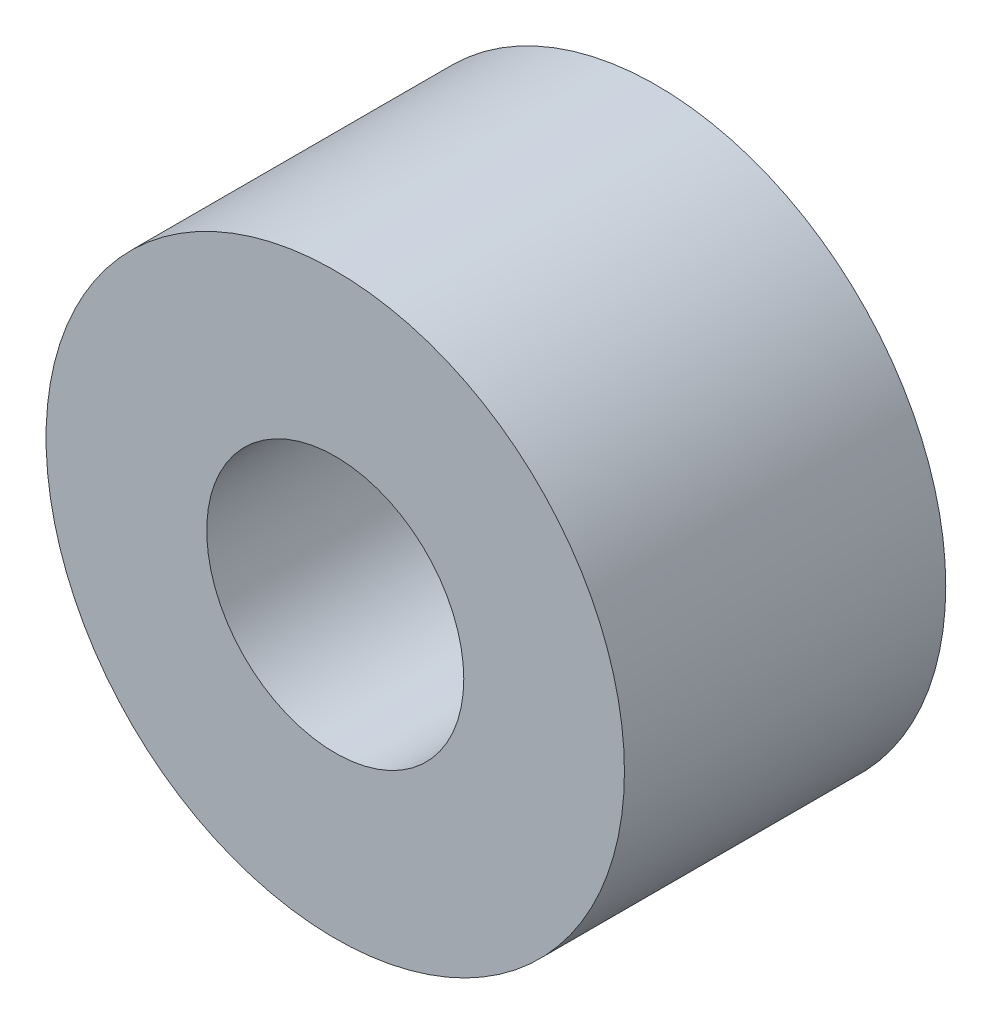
ISO-10303-21;
HEADER;
FILE_DESCRIPTION(('STEP AP214'),'2;1');
FILE_NAME('part.step','',(''),(''),'','','');
FILE_SCHEMA(('AUTOMOTIVE_DESIGN { 1 0 10303 214 1 1 1 1 }'));
ENDSEC;
DATA;
#1=APPLICATION_CONTEXT('core data for automotive mechanical design processes');
#2=APPLICATION_PROTOCOL_DEFINITION('international standard','automotive_design',2000,#1);
#3=PRODUCT_CONTEXT('',#1,'mechanical');
#4=PRODUCT('Part','Part','',(#3));
#5=PRODUCT_RELATED_PRODUCT_CATEGORY('part','',(#4));
#6=PRODUCT_DEFINITION_FORMATION('','',#4);
#7=PRODUCT_DEFINITION_CONTEXT('part definition',#1,'design');
#8=PRODUCT_DEFINITION('design','',#6,#7);
#9=PRODUCT_DEFINITION_SHAPE('','',#8);
#10=(LENGTH_UNIT() NAMED_UNIT(*) SI_UNIT(.MILLI.,.METRE.));
#11=(NAMED_UNIT(*) PLANE_ANGLE_UNIT() SI_UNIT($,.RADIAN.));
#12=(NAMED_UNIT(*) SI_UNIT($,.STERADIAN.) SOLID_ANGLE_UNIT());
#13=UNCERTAINTY_MEASURE_WITH_UNIT(LENGTH_MEASURE(1.E-05),#10,'distance_accuracy_value','');
#14=(GEOMETRIC_REPRESENTATION_CONTEXT(3) GLOBAL_UNCERTAINTY_ASSIGNED_CONTEXT((#13)) GLOBAL_UNIT_ASSIGNED_CONTEXT((#10,
#11,#12)) REPRESENTATION_CONTEXT('',''));
#15=CARTESIAN_POINT('',(0.,0.,0.));
#16=DIRECTION('',(0.,0.,1.));
#17=DIRECTION('',(1.,0.,0.));
#18=AXIS2_PLACEMENT_3D('',#15,#16,#17);
#19=CARTESIAN_POINT('',(0.,0.,5.));
#20=DIRECTION('',(0.,0.,1.));
#21=DIRECTION('',(1.,0.,0.));
#22=AXIS2_PLACEMENT_3D('',#19,#20,#21);
#23=PLANE('',#22);
#24=CARTESIAN_POINT('',(0.,0.,5.));
#25=DIRECTION('',(0.,0.,1.));
#26=DIRECTION('',(1.,0.,0.));
#27=AXIS2_PLACEMENT_3D('',#24,#25,#26);
#28=CIRCLE('',#27,4.5);
#29=CARTESIAN_POINT('',(4.5,0.,5.));
#30=VERTEX_POINT('',#29);
#31=EDGE_CURVE('E10',#30,#30,#28,.T.);
#32=ORIENTED_EDGE('',*,*,#31,.T.);
#33=EDGE_LOOP('',(#32));
#34=FACE_BOUND('',#33,.T.);
#35=CARTESIAN_POINT('',(0.,0.,5.));
#36=DIRECTION('',(0.,0.,1.));
#37=DIRECTION('',(1.,0.,0.));
#38=AXIS2_PLACEMENT_3D('',#35,#36,#37);
#39=CIRCLE('',#38,2.);
#40=CARTESIAN_POINT('',(2.,0.,5.));
#41=VERTEX_POINT('',#40);
#42=EDGE_CURVE('E35',#41,#41,#39,.T.);
#43=ORIENTED_EDGE('',*,*,#42,.F.);
#44=EDGE_LOOP('',(#43));
#45=FACE_BOUND('',#44,.T.);
#46=ADVANCED_FACE('F24',(#34,#45),#23,.T.);
#47=CARTESIAN_POINT('',(0.,0.,0.));
#48=DIRECTION('',(0.,0.,1.));
#49=DIRECTION('',(1.,0.,0.));
#50=AXIS2_PLACEMENT_3D('',#47,#48,#49);
#51=PLANE('',#50);
#52=CARTESIAN_POINT('',(0.,0.,0.));
#53=DIRECTION('',(0.,0.,1.));
#54=DIRECTION('',(1.,0.,0.));
#55=AXIS2_PLACEMENT_3D('',#52,#53,#54);
#56=CIRCLE('',#55,4.5);
#57=CARTESIAN_POINT('',(4.5,0.,0.));
#58=VERTEX_POINT('',#57);
#59=EDGE_CURVE('E31',#58,#58,#56,.T.);
#60=ORIENTED_EDGE('',*,*,#59,.F.);
#61=EDGE_LOOP('',(#60));
#62=FACE_BOUND('',#61,.T.);
#63=CARTESIAN_POINT('',(0.,0.,0.));
#64=DIRECTION('',(0.,0.,1.));
#65=DIRECTION('',(1.,0.,0.));
#66=AXIS2_PLACEMENT_3D('',#63,#64,#65);
#67=CIRCLE('',#66,2.);
#68=CARTESIAN_POINT('',(2.,0.,0.));
#69=VERTEX_POINT('',#68);
#70=EDGE_CURVE('E39',#69,#69,#67,.T.);
#71=ORIENTED_EDGE('',*,*,#70,.T.);
#72=EDGE_LOOP('',(#71));
#73=FACE_BOUND('',#72,.T.);
#74=ADVANCED_FACE('F45',(#62,#73),#51,.F.);
#75=CARTESIAN_POINT('',(0.,0.,5.));
#76=DIRECTION('',(0.,0.,-1.));
#77=DIRECTION('',(-1.,0.,0.));
#78=AXIS2_PLACEMENT_3D('',#75,#76,#77);
#79=CYLINDRICAL_SURFACE('',#78,4.5);
#80=ORIENTED_EDGE('',*,*,#31,.F.);
#81=EDGE_LOOP('',(#80));
#82=FACE_BOUND('',#81,.T.);
#83=ORIENTED_EDGE('',*,*,#59,.T.);
#84=EDGE_LOOP('',(#83));
#85=FACE_BOUND('',#84,.T.);
#86=ADVANCED_FACE('F26',(#82,#85),#79,.T.);
#87=CARTESIAN_POINT('',(0.,0.,5.));
#88=DIRECTION('',(0.,0.,-1.));
#89=DIRECTION('',(-1.,0.,0.));
#90=AXIS2_PLACEMENT_3D('',#87,#88,#89);
#91=CYLINDRICAL_SURFACE('',#90,2.);
#92=ORIENTED_EDGE('',*,*,#42,.T.);
#93=EDGE_LOOP('',(#92));
#94=FACE_BOUND('',#93,.T.);
#95=ORIENTED_EDGE('',*,*,#70,.F.);
#96=EDGE_LOOP('',(#95));
#97=FACE_BOUND('',#96,.T.);
#98=ADVANCED_FACE('F47',(#94,#97),#91,.F.);
#99=CLOSED_SHELL('',(#46,#74,#86,#98));
#100=MANIFOLD_SOLID_BREP('B2',#99);
#101=ADVANCED_BREP_SHAPE_REPRESENTATION('',(#18,#100),#14);
#102=SHAPE_DEFINITION_REPRESENTATION(#9,#101);
ENDSEC;
END-ISO-10303-21;
